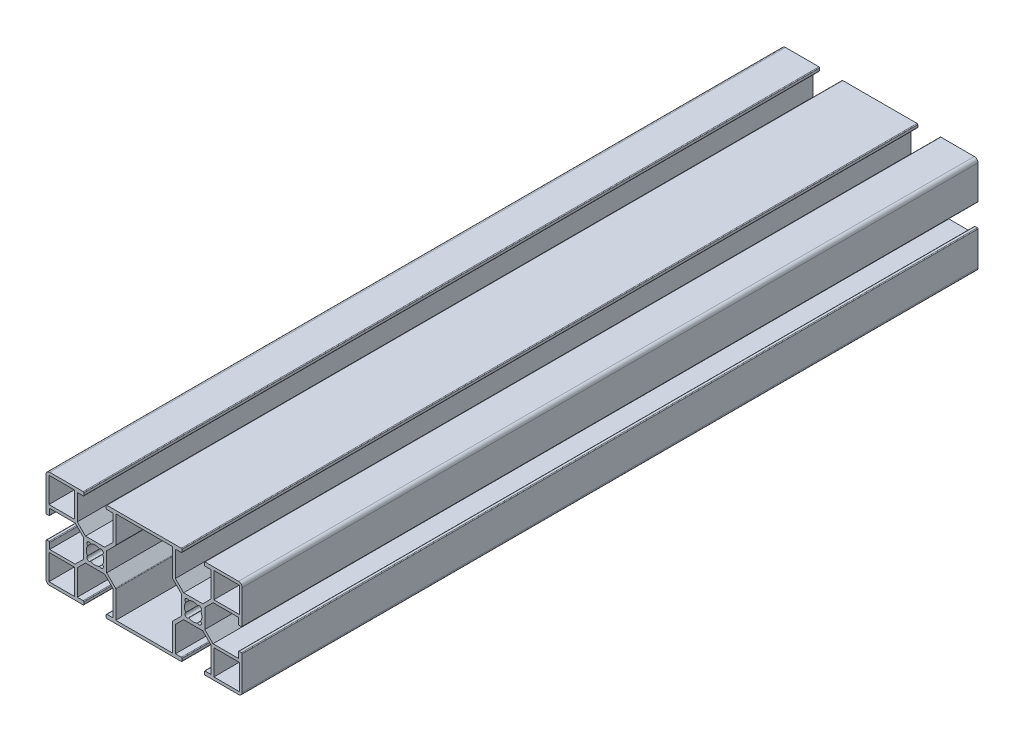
from build123d import *

# Parameters (mm, degrees)
SKETCH_1_W      = 10.35
SKETCH_1_H      = 10.35
EXTRUDE_1_DEPTH = 300


with BuildPart() as part:
    # Sketch 1 → Extrude 1 (new body)
    with BuildSketch(Plane.XY):
        with BuildLine():
            Line((19.7, -4.55), (18.8, -4.55))
            ThreePointArc((18.8, -4.55), (18.587867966, -4.637867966), (18.5, -4.85))
            Line((18.5, -4.85), (18.5, -7.25))
            Line((18.5, -7.25), (8.098528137, -7.25))
            Line((8.098528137, -7.25), (4.75, -3.901471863))
            Line((4.75, -3.901471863), (4.75, 3.901471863))
            Line((4.75, 3.901471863), (8.098528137, 7.25))
            Line((8.098528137, 7.25), (18.5, 7.25))
            Line((18.5, 7.25), (18.5, 4.85))
            ThreePointArc((18.5, 4.85), (18.587867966, 4.637867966), (18.8, 4.55))
            Line((18.8, 4.55), (19.7, 4.55))
            ThreePointArc((19.7, 4.55), (19.912132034, 4.637867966), (20, 4.85))
            Line((20, 4.85), (20, 18.5))
            ThreePointArc((20, 18.5), (19.560660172, 19.560660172), (18.5, 20))
            Line((18.5, 20), (4.85, 20))
            ThreePointArc((4.85, 20), (4.637867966, 19.912132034), (4.55, 19.7))
            Line((4.55, 19.7), (4.55, 18.8))
            ThreePointArc((4.55, 18.8), (4.637867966, 18.587867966), (4.85, 18.5))
            Line((4.85, 18.5), (7.25, 18.5))
            Line((7.25, 18.5), (7.25, 8.098528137))
            Line((7.25, 8.098528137), (3.901471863, 4.75))
            Line((3.901471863, 4.75), (-3.901471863, 4.75))
            Line((-3.901471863, 4.75), (-7.25, 8.098528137))
            Line((-7.25, 8.098528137), (-7.25, 18.5))
            Line((-7.25, 18.5), (-4.85, 18.5))
            ThreePointArc((-4.85, 18.5), (-4.637867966, 18.587867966), (-4.55, 18.8))
            Line((-4.55, 18.8), (-4.55, 19.7))
            ThreePointArc((-4.55, 19.7), (-4.637867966, 19.912132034), (-4.85, 20))
            Line((-4.85, 20), (-35.15, 20))
            ThreePointArc((-35.15, 20), (-35.362132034, 19.912132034), (-35.45, 19.7))
            Line((-35.45, 19.7), (-35.45, 18.8))
            ThreePointArc((-35.45, 18.8), (-35.362132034, 18.587867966), (-35.15, 18.5))
            Line((-35.15, 18.5), (-32.75, 18.5))
            Line((-32.75, 18.5), (-32.75, 8.098528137))
            Line((-32.75, 8.098528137), (-36.098528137, 4.75))
            Line((-36.098528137, 4.75), (-43.901471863, 4.75))
            Line((-43.901471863, 4.75), (-47.25, 8.098528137))
            Line((-47.25, 8.098528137), (-47.25, 18.5))
            Line((-47.25, 18.5), (-44.85, 18.5))
            ThreePointArc((-44.85, 18.5), (-44.637867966, 18.587867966), (-44.55, 18.8))
            Line((-44.55, 18.8), (-44.55, 19.7))
            ThreePointArc((-44.55, 19.7), (-44.637867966, 19.912132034), (-44.85, 20))
            Line((-44.85, 20), (-58.5, 20))
            ThreePointArc((-58.5, 20), (-59.560660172, 19.560660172), (-60, 18.5))
            Line((-60, 18.5), (-60, 4.85))
            ThreePointArc((-60, 4.85), (-59.912132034, 4.637867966), (-59.7, 4.55))
            Line((-59.7, 4.55), (-58.8, 4.55))
            ThreePointArc((-58.8, 4.55), (-58.587867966, 4.637867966), (-58.5, 4.85))
            Line((-58.5, 4.85), (-58.5, 7.25))
            Line((-58.5, 7.25), (-48.098528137, 7.25))
            Line((-48.098528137, 7.25), (-44.75, 3.901471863))
            Line((-44.75, 3.901471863), (-44.75, -3.901471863))
            Line((-44.75, -3.901471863), (-48.098528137, -7.25))
            Line((-48.098528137, -7.25), (-58.5, -7.25))
            Line((-58.5, -7.25), (-58.5, -4.85))
            ThreePointArc((-58.5, -4.85), (-58.587867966, -4.637867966), (-58.8, -4.55))
            Line((-58.8, -4.55), (-59.7, -4.55))
            ThreePointArc((-59.7, -4.55), (-59.912132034, -4.637867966), (-60, -4.85))
            Line((-60, -4.85), (-60, -18.5))
            ThreePointArc((-60, -18.5), (-59.560660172, -19.560660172), (-58.5, -20))
            Line((-58.5, -20), (-44.85, -20))
            ThreePointArc((-44.85, -20), (-44.637867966, -19.912132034), (-44.55, -19.7))
            Line((-44.55, -19.7), (-44.55, -18.8))
            ThreePointArc((-44.55, -18.8), (-44.637867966, -18.587867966), (-44.85, -18.5))
            Line((-44.85, -18.5), (-47.25, -18.5))
            Line((-47.25, -18.5), (-47.25, -8.098528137))
            Line((-47.25, -8.098528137), (-43.901471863, -4.75))
            Line((-43.901471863, -4.75), (-36.098528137, -4.75))
            Line((-36.098528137, -4.75), (-32.75, -8.098528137))
            Line((-32.75, -8.098528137), (-32.75, -18.5))
            Line((-32.75, -18.5), (-35.15, -18.5))
            ThreePointArc((-35.15, -18.5), (-35.362132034, -18.587867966), (-35.45, -18.8))
            Line((-35.45, -18.8), (-35.45, -19.7))
            ThreePointArc((-35.45, -19.7), (-35.362132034, -19.912132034), (-35.15, -20))
            Line((-35.15, -20), (-4.85, -20))
            ThreePointArc((-4.85, -20), (-4.637867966, -19.912132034), (-4.55, -19.7))
            Line((-4.55, -19.7), (-4.55, -18.8))
            ThreePointArc((-4.55, -18.8), (-4.637867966, -18.587867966), (-4.85, -18.5))
            Line((-4.85, -18.5), (-7.25, -18.5))
            Line((-7.25, -18.5), (-7.25, -8.098528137))
            Line((-7.25, -8.098528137), (-3.901471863, -4.75))
            Line((-3.901471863, -4.75), (3.901471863, -4.75))
            Line((3.901471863, -4.75), (7.25, -8.098528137))
            Line((7.25, -8.098528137), (7.25, -18.5))
            Line((7.25, -18.5), (4.85, -18.5))
            ThreePointArc((4.85, -18.5), (4.637867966, -18.587867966), (4.55, -18.8))
            Line((4.55, -18.8), (4.55, -19.7))
            ThreePointArc((4.55, -19.7), (4.637867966, -19.912132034), (4.85, -20))
            Line((4.85, -20), (18.5, -20))
            ThreePointArc((18.5, -20), (19.560660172, -19.560660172), (20, -18.5))
            Line((20, -18.5), (20, -4.85))
            ThreePointArc((20, -4.85), (19.912132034, -4.637867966), (19.7, -4.55))
        make_face()
        with Locations((13.625, -13.625)):
            Rectangle(SKETCH_1_W, SKETCH_1_H, mode=Mode.SUBTRACT)
        with Locations((13.625, 13.625)):
            Rectangle(SKETCH_1_W, SKETCH_1_H, mode=Mode.SUBTRACT)
        with Locations((-53.625, -13.625)):
            Rectangle(SKETCH_1_W, SKETCH_1_H, mode=Mode.SUBTRACT)
        with Locations((-53.625, 13.625)):
            Rectangle(SKETCH_1_W, SKETCH_1_H, mode=Mode.SUBTRACT)
        with BuildLine():
            Line((-41.791823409, 3.064615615), (-41.838477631, 3.111269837))
            ThreePointArc((-41.838477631, 3.111269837), (-43.111269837, 3.111269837), (-43.111269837, 1.838477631))
            Line((-43.111269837, 1.838477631), (-43.064615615, 1.791823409))
            ThreePointArc((-43.064615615, 1.791823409), (-43.55, 0), (-43.064615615, -1.791823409))
            Line((-43.064615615, -1.791823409), (-43.111269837, -1.838477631))
            ThreePointArc((-43.111269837, -1.838477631), (-43.111269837, -3.111269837), (-41.838477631, -3.111269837))
            Line((-41.838477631, -3.111269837), (-41.791823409, -3.064615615))
            ThreePointArc((-41.791823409, -3.064615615), (-40, -3.55), (-38.208176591, -3.064615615))
            Line((-38.208176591, -3.064615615), (-38.161522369, -3.111269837))
            ThreePointArc((-38.161522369, -3.111269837), (-36.888730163, -3.111269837), (-36.888730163, -1.838477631))
            Line((-36.888730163, -1.838477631), (-36.935384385, -1.791823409))
            ThreePointArc((-36.935384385, -1.791823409), (-36.45, 0), (-36.935384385, 1.791823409))
            Line((-36.935384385, 1.791823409), (-36.888730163, 1.838477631))
            ThreePointArc((-36.888730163, 1.838477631), (-36.888730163, 3.111269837), (-38.161522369, 3.111269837))
            Line((-38.161522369, 3.111269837), (-38.208176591, 3.064615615))
            ThreePointArc((-38.208176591, 3.064615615), (-40, 3.55), (-41.791823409, 3.064615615))
        make_face(mode=Mode.SUBTRACT)
        with BuildLine():
            Line((-35.25, 3.901471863), (-35.25, -3.901471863))
            Line((-35.25, -3.901471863), (-31.696446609, -7.455025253))
            ThreePointArc((-31.696446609, -7.455025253), (-31.588060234, -7.617236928), (-31.55, -7.808578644))
            Line((-31.55, -7.808578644), (-31.55, -18.8))
            Line((-31.55, -18.8), (-8.45, -18.8))
            Line((-8.45, -18.8), (-8.45, -7.808578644))
            ThreePointArc((-8.45, -7.808578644), (-8.411939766, -7.617236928), (-8.303553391, -7.455025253))
            Line((-8.303553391, -7.455025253), (-4.75, -3.901471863))
            Line((-4.75, -3.901471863), (-4.75, 3.901471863))
            Line((-4.75, 3.901471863), (-8.303553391, 7.455025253))
            ThreePointArc((-8.303553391, 7.455025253), (-8.411939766, 7.617236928), (-8.45, 7.808578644))
            Line((-8.45, 7.808578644), (-8.45, 18.8))
            Line((-8.45, 18.8), (-31.55, 18.8))
            Line((-31.55, 18.8), (-31.55, 7.808578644))
            ThreePointArc((-31.55, 7.808578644), (-31.588060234, 7.617236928), (-31.696446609, 7.455025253))
            Line((-31.696446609, 7.455025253), (-35.25, 3.901471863))
        make_face(mode=Mode.SUBTRACT)
        with BuildLine():
            Line((-3.111269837, 1.838477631), (-3.064615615, 1.791823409))
            ThreePointArc((-3.064615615, 1.791823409), (-3.55, 0), (-3.064615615, -1.791823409))
            Line((-3.064615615, -1.791823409), (-3.111269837, -1.838477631))
            ThreePointArc((-3.111269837, -1.838477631), (-3.111269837, -3.111269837), (-1.838477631, -3.111269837))
            Line((-1.838477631, -3.111269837), (-1.791823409, -3.064615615))
            ThreePointArc((-1.791823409, -3.064615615), (0, -3.55), (1.791823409, -3.064615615))
            Line((1.791823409, -3.064615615), (1.838477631, -3.111269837))
            ThreePointArc((1.838477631, -3.111269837), (3.111269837, -3.111269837), (3.111269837, -1.838477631))
            Line((3.111269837, -1.838477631), (3.064615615, -1.791823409))
            ThreePointArc((3.064615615, -1.791823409), (3.55, 0), (3.064615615, 1.791823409))
            Line((3.064615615, 1.791823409), (3.111269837, 1.838477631))
            ThreePointArc((3.111269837, 1.838477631), (3.111269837, 3.111269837), (1.838477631, 3.111269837))
            Line((1.838477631, 3.111269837), (1.791823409, 3.064615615))
            ThreePointArc((1.791823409, 3.064615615), (0, 3.55), (-1.791823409, 3.064615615))
            Line((-1.791823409, 3.064615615), (-1.838477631, 3.111269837))
            ThreePointArc((-1.838477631, 3.111269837), (-3.111269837, 3.111269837), (-3.111269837, 1.838477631))
        make_face(mode=Mode.SUBTRACT)
    extrude(amount=EXTRUDE_1_DEPTH)


solid = part.part
